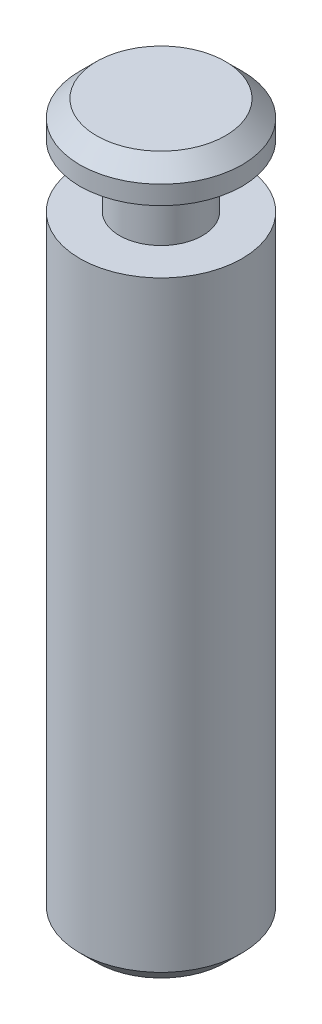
ISO-10303-21;
HEADER;
FILE_DESCRIPTION(('STEP AP214'),'2;1');
FILE_NAME('part.step','',(''),(''),'','','');
FILE_SCHEMA(('AUTOMOTIVE_DESIGN { 1 0 10303 214 1 1 1 1 }'));
ENDSEC;
DATA;
#1=APPLICATION_CONTEXT('core data for automotive mechanical design processes');
#2=APPLICATION_PROTOCOL_DEFINITION('international standard','automotive_design',2000,#1);
#3=PRODUCT_CONTEXT('',#1,'mechanical');
#4=PRODUCT('Part','Part','',(#3));
#5=PRODUCT_RELATED_PRODUCT_CATEGORY('part','',(#4));
#6=PRODUCT_DEFINITION_FORMATION('','',#4);
#7=PRODUCT_DEFINITION_CONTEXT('part definition',#1,'design');
#8=PRODUCT_DEFINITION('design','',#6,#7);
#9=PRODUCT_DEFINITION_SHAPE('','',#8);
#10=(LENGTH_UNIT() NAMED_UNIT(*) SI_UNIT(.MILLI.,.METRE.));
#11=(NAMED_UNIT(*) PLANE_ANGLE_UNIT() SI_UNIT($,.RADIAN.));
#12=(NAMED_UNIT(*) SI_UNIT($,.STERADIAN.) SOLID_ANGLE_UNIT());
#13=UNCERTAINTY_MEASURE_WITH_UNIT(LENGTH_MEASURE(1.E-05),#10,'distance_accuracy_value','');
#14=(GEOMETRIC_REPRESENTATION_CONTEXT(3) GLOBAL_UNCERTAINTY_ASSIGNED_CONTEXT((#13)) GLOBAL_UNIT_ASSIGNED_CONTEXT((#10,
#11,#12)) REPRESENTATION_CONTEXT('',''));
#15=CARTESIAN_POINT('',(0.,0.,0.));
#16=DIRECTION('',(0.,0.,1.));
#17=DIRECTION('',(1.,0.,0.));
#18=AXIS2_PLACEMENT_3D('',#15,#16,#17);
#19=CARTESIAN_POINT('',(0.,48.8442,0.));
#20=DIRECTION('',(0.,-1.,0.));
#21=DIRECTION('',(0.,0.,-1.));
#22=AXIS2_PLACEMENT_3D('',#19,#20,#21);
#23=CYLINDRICAL_SURFACE('',#22,5.5372);
#24=CARTESIAN_POINT('',(0.,42.164,0.));
#25=DIRECTION('',(0.,-1.,0.));
#26=DIRECTION('',(0.,0.,-1.));
#27=AXIS2_PLACEMENT_3D('',#24,#25,#26);
#28=CIRCLE('',#27,5.5372);
#29=CARTESIAN_POINT('',(0.,42.164,-5.5372));
#30=VERTEX_POINT('',#29);
#31=EDGE_CURVE('E36',#30,#30,#28,.T.);
#32=ORIENTED_EDGE('',*,*,#31,.T.);
#33=EDGE_LOOP('',(#32));
#34=FACE_BOUND('',#33,.T.);
#35=CARTESIAN_POINT('',(0.,1.143,0.));
#36=DIRECTION('',(0.,1.,0.));
#37=DIRECTION('',(0.,0.,1.));
#38=AXIS2_PLACEMENT_3D('',#35,#36,#37);
#39=CIRCLE('',#38,5.5372);
#40=CARTESIAN_POINT('',(0.,1.143,5.5372));
#41=VERTEX_POINT('',#40);
#42=EDGE_CURVE('E45',#41,#41,#39,.T.);
#43=ORIENTED_EDGE('',*,*,#42,.T.);
#44=EDGE_LOOP('',(#43));
#45=FACE_BOUND('',#44,.T.);
#46=ADVANCED_FACE('F32',(#34,#45),#23,.T.);
#47=CARTESIAN_POINT('',(0.,0.,0.));
#48=DIRECTION('',(0.,1.,0.));
#49=DIRECTION('',(0.,0.,1.));
#50=AXIS2_PLACEMENT_3D('',#47,#48,#49);
#51=PLANE('',#50);
#52=CARTESIAN_POINT('',(0.,0.,0.));
#53=DIRECTION('',(0.,1.,0.));
#54=DIRECTION('',(0.,0.,1.));
#55=AXIS2_PLACEMENT_3D('',#52,#53,#54);
#56=CIRCLE('',#55,4.3942);
#57=CARTESIAN_POINT('',(0.,0.,4.3942));
#58=VERTEX_POINT('',#57);
#59=EDGE_CURVE('E10',#58,#58,#56,.F.);
#60=ORIENTED_EDGE('',*,*,#59,.T.);
#61=EDGE_LOOP('',(#60));
#62=FACE_BOUND('',#61,.T.);
#63=ADVANCED_FACE('F70',(#62),#51,.F.);
#64=CARTESIAN_POINT('',(0.,1.143,0.));
#65=DIRECTION('',(0.,1.,0.));
#66=DIRECTION('',(0.,0.,1.));
#67=AXIS2_PLACEMENT_3D('',#64,#65,#66);
#68=CONICAL_SURFACE('',#67,5.5372,0.785398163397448);
#69=ORIENTED_EDGE('',*,*,#59,.F.);
#70=EDGE_LOOP('',(#69));
#71=FACE_BOUND('',#70,.T.);
#72=ORIENTED_EDGE('',*,*,#42,.F.);
#73=EDGE_LOOP('',(#72));
#74=FACE_BOUND('',#73,.T.);
#75=ADVANCED_FACE('F34',(#71,#74),#68,.T.);
#76=CARTESIAN_POINT('',(0.,42.164,-2.8321));
#77=DIRECTION('',(0.,-1.,0.));
#78=DIRECTION('',(0.,0.,-1.));
#79=AXIS2_PLACEMENT_3D('',#76,#77,#78);
#80=PLANE('',#79);
#81=CARTESIAN_POINT('',(0.,42.164,0.));
#82=DIRECTION('',(0.,-1.,0.));
#83=DIRECTION('',(0.,0.,-1.));
#84=AXIS2_PLACEMENT_3D('',#81,#82,#83);
#85=CIRCLE('',#84,2.8321);
#86=CARTESIAN_POINT('',(0.,42.164,-2.8321));
#87=VERTEX_POINT('',#86);
#88=EDGE_CURVE('E50',#87,#87,#85,.T.);
#89=ORIENTED_EDGE('',*,*,#88,.T.);
#90=EDGE_LOOP('',(#89));
#91=FACE_BOUND('',#90,.T.);
#92=ORIENTED_EDGE('',*,*,#31,.F.);
#93=EDGE_LOOP('',(#92));
#94=FACE_BOUND('',#93,.T.);
#95=ADVANCED_FACE('F69',(#91,#94),#80,.F.);
#96=CARTESIAN_POINT('',(0.,46.4312,-2.8321));
#97=DIRECTION('',(0.,1.,0.));
#98=DIRECTION('',(0.,0.,1.));
#99=AXIS2_PLACEMENT_3D('',#96,#97,#98);
#100=PLANE('',#99);
#101=CARTESIAN_POINT('',(0.,46.4312,0.));
#102=DIRECTION('',(0.,-1.,0.));
#103=DIRECTION('',(0.,0.,-1.));
#104=AXIS2_PLACEMENT_3D('',#101,#102,#103);
#105=CIRCLE('',#104,2.8321);
#106=CARTESIAN_POINT('',(0.,46.4312,-2.8321));
#107=VERTEX_POINT('',#106);
#108=EDGE_CURVE('E56',#107,#107,#105,.T.);
#109=ORIENTED_EDGE('',*,*,#108,.F.);
#110=EDGE_LOOP('',(#109));
#111=FACE_BOUND('',#110,.T.);
#112=CARTESIAN_POINT('',(0.,46.4312,0.));
#113=DIRECTION('',(0.,1.,0.));
#114=DIRECTION('',(0.,0.,1.));
#115=AXIS2_PLACEMENT_3D('',#112,#113,#114);
#116=CIRCLE('',#115,5.5372);
#117=CARTESIAN_POINT('',(0.,46.4312,5.5372));
#118=VERTEX_POINT('',#117);
#119=EDGE_CURVE('E48',#118,#118,#116,.T.);
#120=ORIENTED_EDGE('',*,*,#119,.F.);
#121=EDGE_LOOP('',(#120));
#122=FACE_BOUND('',#121,.T.);
#123=ADVANCED_FACE('F76',(#111,#122),#100,.F.);
#124=CARTESIAN_POINT('',(0.,0.,0.));
#125=DIRECTION('',(0.,-1.,0.));
#126=DIRECTION('',(0.,0.,-1.));
#127=AXIS2_PLACEMENT_3D('',#124,#125,#126);
#128=CYLINDRICAL_SURFACE('',#127,2.8321);
#129=ORIENTED_EDGE('',*,*,#88,.F.);
#130=EDGE_LOOP('',(#129));
#131=FACE_BOUND('',#130,.T.);
#132=ORIENTED_EDGE('',*,*,#108,.T.);
#133=EDGE_LOOP('',(#132));
#134=FACE_BOUND('',#133,.T.);
#135=ADVANCED_FACE('F98',(#131,#134),#128,.T.);
#136=CARTESIAN_POINT('',(0.,48.8442,0.));
#137=DIRECTION('',(0.,1.,0.));
#138=DIRECTION('',(0.,0.,1.));
#139=AXIS2_PLACEMENT_3D('',#136,#137,#138);
#140=PLANE('',#139);
#141=CARTESIAN_POINT('',(0.,48.8442,0.));
#142=DIRECTION('',(0.,1.,0.));
#143=DIRECTION('',(0.,0.,1.));
#144=AXIS2_PLACEMENT_3D('',#141,#142,#143);
#145=CIRCLE('',#144,4.39420000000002);
#146=CARTESIAN_POINT('',(0.,48.8442,4.39420000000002));
#147=VERTEX_POINT('',#146);
#148=EDGE_CURVE('E54',#147,#147,#145,.T.);
#149=ORIENTED_EDGE('',*,*,#148,.T.);
#150=EDGE_LOOP('',(#149));
#151=FACE_BOUND('',#150,.T.);
#152=ADVANCED_FACE('F90',(#151),#140,.T.);
#153=CARTESIAN_POINT('',(0.,48.8442,0.));
#154=DIRECTION('',(0.,-1.,0.));
#155=DIRECTION('',(0.,0.,-1.));
#156=AXIS2_PLACEMENT_3D('',#153,#154,#155);
#157=CONICAL_SURFACE('',#156,4.39420000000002,0.785398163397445);
#158=CARTESIAN_POINT('',(0.,47.7012,0.));
#159=DIRECTION('',(0.,1.,0.));
#160=DIRECTION('',(0.,0.,1.));
#161=AXIS2_PLACEMENT_3D('',#158,#159,#160);
#162=CIRCLE('',#161,5.5372);
#163=CARTESIAN_POINT('',(0.,47.7012,5.5372));
#164=VERTEX_POINT('',#163);
#165=EDGE_CURVE('E40',#164,#164,#162,.F.);
#166=ORIENTED_EDGE('',*,*,#165,.F.);
#167=EDGE_LOOP('',(#166));
#168=FACE_BOUND('',#167,.T.);
#169=ORIENTED_EDGE('',*,*,#148,.F.);
#170=EDGE_LOOP('',(#169));
#171=FACE_BOUND('',#170,.T.);
#172=ADVANCED_FACE('F86',(#168,#171),#157,.T.);
#173=ORIENTED_EDGE('',*,*,#119,.T.);
#174=EDGE_LOOP('',(#173));
#175=FACE_BOUND('',#174,.T.);
#176=ORIENTED_EDGE('',*,*,#165,.T.);
#177=EDGE_LOOP('',(#176));
#178=FACE_BOUND('',#177,.T.);
#179=ADVANCED_FACE('F82',(#175,#178),#23,.T.);
#180=CLOSED_SHELL('',(#46,#63,#75,#95,#123,#135,#152,#172,#179));
#181=MANIFOLD_SOLID_BREP('B2',#180);
#182=ADVANCED_BREP_SHAPE_REPRESENTATION('',(#18,#181),#14);
#183=SHAPE_DEFINITION_REPRESENTATION(#9,#182);
ENDSEC;
END-ISO-10303-21;
